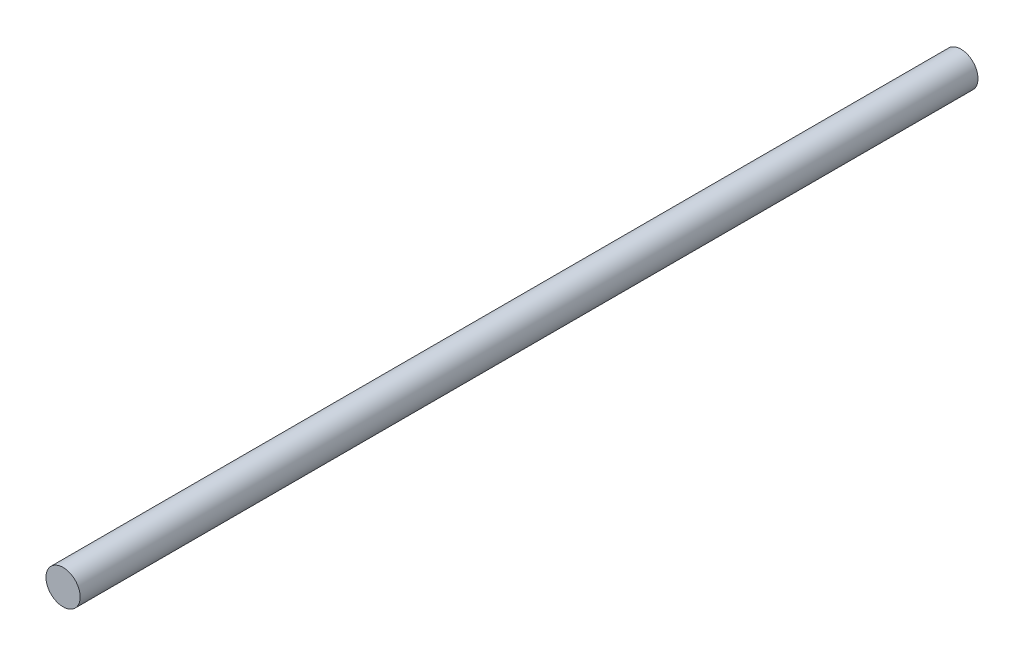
ISO-10303-21;
HEADER;
FILE_DESCRIPTION(('STEP AP214'),'2;1');
FILE_NAME('part.step','',(''),(''),'','','');
FILE_SCHEMA(('AUTOMOTIVE_DESIGN { 1 0 10303 214 1 1 1 1 }'));
ENDSEC;
DATA;
#1=APPLICATION_CONTEXT('core data for automotive mechanical design processes');
#2=APPLICATION_PROTOCOL_DEFINITION('international standard','automotive_design',2000,#1);
#3=PRODUCT_CONTEXT('',#1,'mechanical');
#4=PRODUCT('Part','Part','',(#3));
#5=PRODUCT_RELATED_PRODUCT_CATEGORY('part','',(#4));
#6=PRODUCT_DEFINITION_FORMATION('','',#4);
#7=PRODUCT_DEFINITION_CONTEXT('part definition',#1,'design');
#8=PRODUCT_DEFINITION('design','',#6,#7);
#9=PRODUCT_DEFINITION_SHAPE('','',#8);
#10=(LENGTH_UNIT() NAMED_UNIT(*) SI_UNIT(.MILLI.,.METRE.));
#11=(NAMED_UNIT(*) PLANE_ANGLE_UNIT() SI_UNIT($,.RADIAN.));
#12=(NAMED_UNIT(*) SI_UNIT($,.STERADIAN.) SOLID_ANGLE_UNIT());
#13=UNCERTAINTY_MEASURE_WITH_UNIT(LENGTH_MEASURE(1.E-05),#10,'distance_accuracy_value','');
#14=(GEOMETRIC_REPRESENTATION_CONTEXT(3) GLOBAL_UNCERTAINTY_ASSIGNED_CONTEXT((#13)) GLOBAL_UNIT_ASSIGNED_CONTEXT((#10,
#11,#12)) REPRESENTATION_CONTEXT('',''));
#15=CARTESIAN_POINT('',(0.,0.,0.));
#16=DIRECTION('',(0.,0.,1.));
#17=DIRECTION('',(1.,0.,0.));
#18=AXIS2_PLACEMENT_3D('',#15,#16,#17);
#19=CARTESIAN_POINT('',(0.,0.,21.));
#20=DIRECTION('',(0.,0.,-1.));
#21=DIRECTION('',(-1.,0.,0.));
#22=AXIS2_PLACEMENT_3D('',#19,#20,#21);
#23=CYLINDRICAL_SURFACE('',#22,0.4);
#24=CARTESIAN_POINT('',(0.,0.,21.));
#25=DIRECTION('',(0.,0.,1.));
#26=DIRECTION('',(1.,0.,0.));
#27=AXIS2_PLACEMENT_3D('',#24,#25,#26);
#28=CIRCLE('',#27,0.4);
#29=CARTESIAN_POINT('',(0.4,0.,21.));
#30=VERTEX_POINT('',#29);
#31=EDGE_CURVE('E10',#30,#30,#28,.T.);
#32=ORIENTED_EDGE('',*,*,#31,.F.);
#33=EDGE_LOOP('',(#32));
#34=FACE_BOUND('',#33,.T.);
#35=CARTESIAN_POINT('',(0.,0.,0.));
#36=DIRECTION('',(0.,0.,1.));
#37=DIRECTION('',(1.,0.,0.));
#38=AXIS2_PLACEMENT_3D('',#35,#36,#37);
#39=CIRCLE('',#38,0.4);
#40=CARTESIAN_POINT('',(0.4,0.,0.));
#41=VERTEX_POINT('',#40);
#42=EDGE_CURVE('E32',#41,#41,#39,.T.);
#43=ORIENTED_EDGE('',*,*,#42,.T.);
#44=EDGE_LOOP('',(#43));
#45=FACE_BOUND('',#44,.T.);
#46=ADVANCED_FACE('F29',(#34,#45),#23,.T.);
#47=CARTESIAN_POINT('',(0.,0.,21.));
#48=DIRECTION('',(0.,0.,1.));
#49=DIRECTION('',(1.,0.,0.));
#50=AXIS2_PLACEMENT_3D('',#47,#48,#49);
#51=PLANE('',#50);
#52=ORIENTED_EDGE('',*,*,#31,.T.);
#53=EDGE_LOOP('',(#52));
#54=FACE_BOUND('',#53,.T.);
#55=ADVANCED_FACE('F44',(#54),#51,.T.);
#56=CARTESIAN_POINT('',(0.,0.,0.));
#57=DIRECTION('',(0.,0.,1.));
#58=DIRECTION('',(1.,0.,0.));
#59=AXIS2_PLACEMENT_3D('',#56,#57,#58);
#60=PLANE('',#59);
#61=ORIENTED_EDGE('',*,*,#42,.F.);
#62=EDGE_LOOP('',(#61));
#63=FACE_BOUND('',#62,.T.);
#64=ADVANCED_FACE('F42',(#63),#60,.F.);
#65=CLOSED_SHELL('',(#46,#55,#64));
#66=MANIFOLD_SOLID_BREP('B2',#65);
#67=ADVANCED_BREP_SHAPE_REPRESENTATION('',(#18,#66),#14);
#68=SHAPE_DEFINITION_REPRESENTATION(#9,#67);
ENDSEC;
END-ISO-10303-21;
